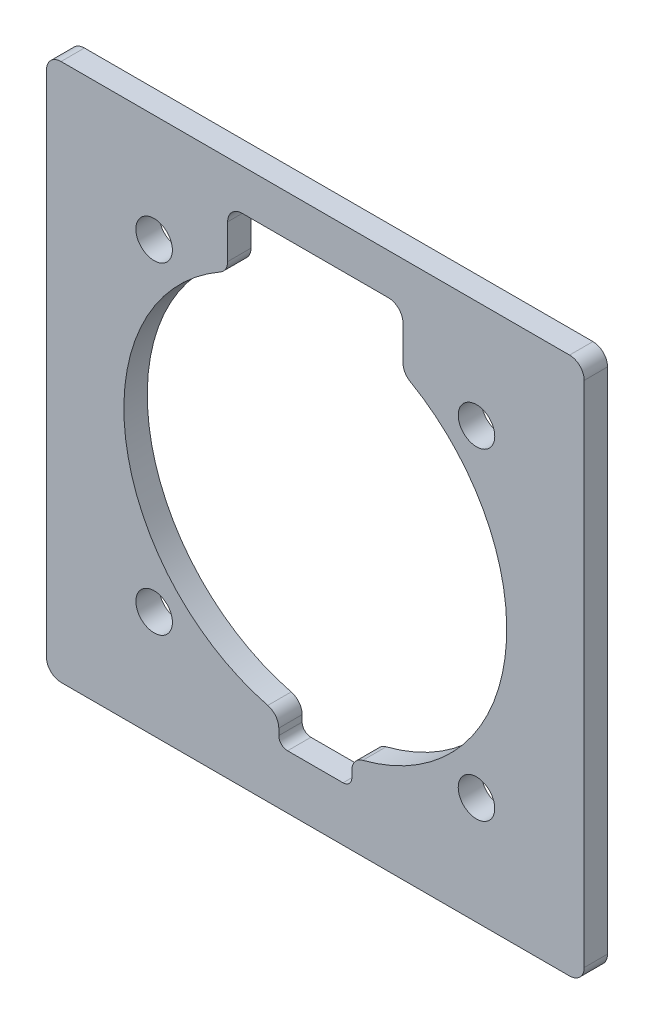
ISO-10303-21;
HEADER;
FILE_DESCRIPTION(('STEP AP214'),'2;1');
FILE_NAME('part.step','',(''),(''),'','','');
FILE_SCHEMA(('AUTOMOTIVE_DESIGN { 1 0 10303 214 1 1 1 1 }'));
ENDSEC;
DATA;
#1=APPLICATION_CONTEXT('core data for automotive mechanical design processes');
#2=APPLICATION_PROTOCOL_DEFINITION('international standard','automotive_design',2000,#1);
#3=PRODUCT_CONTEXT('',#1,'mechanical');
#4=PRODUCT('Part','Part','',(#3));
#5=PRODUCT_RELATED_PRODUCT_CATEGORY('part','',(#4));
#6=PRODUCT_DEFINITION_FORMATION('','',#4);
#7=PRODUCT_DEFINITION_CONTEXT('part definition',#1,'design');
#8=PRODUCT_DEFINITION('design','',#6,#7);
#9=PRODUCT_DEFINITION_SHAPE('','',#8);
#10=(LENGTH_UNIT() NAMED_UNIT(*) SI_UNIT(.MILLI.,.METRE.));
#11=(NAMED_UNIT(*) PLANE_ANGLE_UNIT() SI_UNIT($,.RADIAN.));
#12=(NAMED_UNIT(*) SI_UNIT($,.STERADIAN.) SOLID_ANGLE_UNIT());
#13=UNCERTAINTY_MEASURE_WITH_UNIT(LENGTH_MEASURE(1.E-05),#10,'distance_accuracy_value','');
#14=(GEOMETRIC_REPRESENTATION_CONTEXT(3) GLOBAL_UNCERTAINTY_ASSIGNED_CONTEXT((#13)) GLOBAL_UNIT_ASSIGNED_CONTEXT((#10,
#11,#12)) REPRESENTATION_CONTEXT('',''));
#15=CARTESIAN_POINT('',(0.,0.,0.));
#16=DIRECTION('',(0.,0.,1.));
#17=DIRECTION('',(1.,0.,0.));
#18=AXIS2_PLACEMENT_3D('',#15,#16,#17);
#19=CARTESIAN_POINT('',(-87.,-87.,8.));
#20=DIRECTION('',(0.,0.,1.));
#21=DIRECTION('',(1.,0.,0.));
#22=AXIS2_PLACEMENT_3D('',#19,#20,#21);
#23=PLANE('',#22);
#24=CARTESIAN_POINT('',(55.15,-55.15,8.));
#25=DIRECTION('',(0.,0.,1.));
#26=DIRECTION('',(-1.,0.,0.));
#27=AXIS2_PLACEMENT_3D('',#24,#25,#26);
#28=CIRCLE('',#27,6.25);
#29=CARTESIAN_POINT('',(48.9,-55.15,8.));
#30=VERTEX_POINT('',#29);
#31=EDGE_CURVE('E530',#30,#30,#28,.T.);
#32=ORIENTED_EDGE('',*,*,#31,.F.);
#33=EDGE_LOOP('',(#32));
#34=FACE_BOUND('',#33,.T.);
#35=DIRECTION('',(0.,-1.,0.));
#36=VECTOR('',#35,1.);
#37=CARTESIAN_POINT('',(-30.,73.,8.));
#38=LINE('',#37,#36);
#39=CARTESIAN_POINT('',(-30.,73.,8.));
#40=VERTEX_POINT('',#39);
#41=CARTESIAN_POINT('',(-30.,61.1984476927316,8.));
#42=VERTEX_POINT('',#41);
#43=EDGE_CURVE('E259',#40,#42,#38,.T.);
#44=ORIENTED_EDGE('',*,*,#43,.F.);
#45=CARTESIAN_POINT('',(-25.,73.,8.));
#46=DIRECTION('',(0.,0.,1.));
#47=DIRECTION('',(-1.,0.,0.));
#48=AXIS2_PLACEMENT_3D('',#45,#46,#47);
#49=CIRCLE('',#48,5.);
#50=CARTESIAN_POINT('',(-25.,78.,8.));
#51=VERTEX_POINT('',#50);
#52=EDGE_CURVE('E206',#51,#40,#49,.T.);
#53=ORIENTED_EDGE('',*,*,#52,.F.);
#54=DIRECTION('',(-1.,0.,0.));
#55=VECTOR('',#54,1.);
#56=CARTESIAN_POINT('',(25.,78.,8.));
#57=LINE('',#56,#55);
#58=CARTESIAN_POINT('',(25.,78.,8.));
#59=VERTEX_POINT('',#58);
#60=EDGE_CURVE('E287',#59,#51,#57,.T.);
#61=ORIENTED_EDGE('',*,*,#60,.F.);
#62=CARTESIAN_POINT('',(25.,73.,8.));
#63=DIRECTION('',(0.,0.,1.));
#64=DIRECTION('',(1.,0.,0.));
#65=AXIS2_PLACEMENT_3D('',#62,#63,#64);
#66=CIRCLE('',#65,5.);
#67=CARTESIAN_POINT('',(30.,73.,8.));
#68=VERTEX_POINT('',#67);
#69=EDGE_CURVE('E285',#68,#59,#66,.T.);
#70=ORIENTED_EDGE('',*,*,#69,.F.);
#71=DIRECTION('',(0.,1.,0.));
#72=VECTOR('',#71,1.);
#73=CARTESIAN_POINT('',(30.,73.,8.));
#74=LINE('',#73,#72);
#75=CARTESIAN_POINT('',(30.,61.1984476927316,8.));
#76=VERTEX_POINT('',#75);
#77=EDGE_CURVE('E283',#76,#68,#74,.T.);
#78=ORIENTED_EDGE('',*,*,#77,.F.);
#79=CARTESIAN_POINT('',(35.,61.1984476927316,8.));
#80=DIRECTION('',(0.,0.,-1.));
#81=DIRECTION('',(-1.,0.,0.));
#82=AXIS2_PLACEMENT_3D('',#79,#80,#81);
#83=CIRCLE('',#82,5.);
#84=CARTESIAN_POINT('',(32.5177304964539,56.8581322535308,8.));
#85=VERTEX_POINT('',#84);
#86=EDGE_CURVE('E281',#85,#76,#83,.T.);
#87=ORIENTED_EDGE('',*,*,#86,.F.);
#88=CARTESIAN_POINT('',(0.,0.,8.));
#89=DIRECTION('',(0.,0.,1.));
#90=DIRECTION('',(-1.,0.,0.));
#91=AXIS2_PLACEMENT_3D('',#88,#89,#90);
#92=CIRCLE('',#91,65.5);
#93=CARTESIAN_POINT('',(16.258865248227,-63.4499747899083,8.));
#94=VERTEX_POINT('',#93);
#95=EDGE_CURVE('E279',#94,#85,#92,.T.);
#96=ORIENTED_EDGE('',*,*,#95,.F.);
#97=CARTESIAN_POINT('',(17.5,-68.2934843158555,8.));
#98=DIRECTION('',(0.,0.,-1.));
#99=DIRECTION('',(-1.,0.,0.));
#100=AXIS2_PLACEMENT_3D('',#97,#98,#99);
#101=CIRCLE('',#100,5.);
#102=CARTESIAN_POINT('',(12.5,-68.2934843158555,8.));
#103=VERTEX_POINT('',#102);
#104=EDGE_CURVE('E277',#103,#94,#101,.T.);
#105=ORIENTED_EDGE('',*,*,#104,.F.);
#106=DIRECTION('',(0.,1.,0.));
#107=VECTOR('',#106,1.);
#108=CARTESIAN_POINT('',(12.5,-68.2934843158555,8.));
#109=LINE('',#108,#107);
#110=CARTESIAN_POINT('',(12.5,-70.5,8.));
#111=VERTEX_POINT('',#110);
#112=EDGE_CURVE('E275',#111,#103,#109,.T.);
#113=ORIENTED_EDGE('',*,*,#112,.F.);
#114=CARTESIAN_POINT('',(9.5,-70.5,8.));
#115=DIRECTION('',(0.,0.,1.));
#116=DIRECTION('',(1.,0.,0.));
#117=AXIS2_PLACEMENT_3D('',#114,#115,#116);
#118=CIRCLE('',#117,3.);
#119=CARTESIAN_POINT('',(9.5,-73.5,8.));
#120=VERTEX_POINT('',#119);
#121=EDGE_CURVE('E273',#120,#111,#118,.T.);
#122=ORIENTED_EDGE('',*,*,#121,.F.);
#123=DIRECTION('',(1.,0.,0.));
#124=VECTOR('',#123,1.);
#125=CARTESIAN_POINT('',(-9.49999999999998,-73.5,8.));
#126=LINE('',#125,#124);
#127=CARTESIAN_POINT('',(-9.49999999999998,-73.5,8.));
#128=VERTEX_POINT('',#127);
#129=EDGE_CURVE('E271',#128,#120,#126,.T.);
#130=ORIENTED_EDGE('',*,*,#129,.F.);
#131=CARTESIAN_POINT('',(-9.49999999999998,-70.5,8.));
#132=DIRECTION('',(0.,0.,1.));
#133=DIRECTION('',(-1.,0.,0.));
#134=AXIS2_PLACEMENT_3D('',#131,#132,#133);
#135=CIRCLE('',#134,3.);
#136=CARTESIAN_POINT('',(-12.5,-70.5,8.));
#137=VERTEX_POINT('',#136);
#138=EDGE_CURVE('E269',#137,#128,#135,.T.);
#139=ORIENTED_EDGE('',*,*,#138,.F.);
#140=DIRECTION('',(0.,-1.,0.));
#141=VECTOR('',#140,1.);
#142=CARTESIAN_POINT('',(-12.5,-68.2934843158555,8.));
#143=LINE('',#142,#141);
#144=CARTESIAN_POINT('',(-12.5,-68.2934843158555,8.));
#145=VERTEX_POINT('',#144);
#146=EDGE_CURVE('E267',#145,#137,#143,.T.);
#147=ORIENTED_EDGE('',*,*,#146,.F.);
#148=CARTESIAN_POINT('',(-17.5,-68.2934843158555,8.));
#149=DIRECTION('',(0.,0.,-1.));
#150=DIRECTION('',(1.,0.,0.));
#151=AXIS2_PLACEMENT_3D('',#148,#149,#150);
#152=CIRCLE('',#151,5.);
#153=CARTESIAN_POINT('',(-16.2588652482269,-63.4499747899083,8.));
#154=VERTEX_POINT('',#153);
#155=EDGE_CURVE('E265',#154,#145,#152,.T.);
#156=ORIENTED_EDGE('',*,*,#155,.F.);
#157=CARTESIAN_POINT('',(0.,0.,8.));
#158=DIRECTION('',(0.,0.,1.));
#159=DIRECTION('',(1.,0.,0.));
#160=AXIS2_PLACEMENT_3D('',#157,#158,#159);
#161=CIRCLE('',#160,65.5);
#162=CARTESIAN_POINT('',(-32.5177304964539,56.8581322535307,8.));
#163=VERTEX_POINT('',#162);
#164=EDGE_CURVE('E263',#163,#154,#161,.T.);
#165=ORIENTED_EDGE('',*,*,#164,.F.);
#166=CARTESIAN_POINT('',(-35.,61.1984476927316,8.));
#167=DIRECTION('',(0.,0.,-1.));
#168=DIRECTION('',(1.,0.,0.));
#169=AXIS2_PLACEMENT_3D('',#166,#167,#168);
#170=CIRCLE('',#169,5.);
#171=EDGE_CURVE('E261',#42,#163,#170,.T.);
#172=ORIENTED_EDGE('',*,*,#171,.F.);
#173=EDGE_LOOP('',(#44,#53,#61,#70,#78,#87,#96,#105,#113,#122,#130,#139,#147,#156,#165,#172));
#174=FACE_BOUND('',#173,.T.);
#175=CARTESIAN_POINT('',(-87.,-87.,8.));
#176=DIRECTION('',(0.,0.,1.));
#177=DIRECTION('',(1.,0.,0.));
#178=AXIS2_PLACEMENT_3D('',#175,#176,#177);
#179=CIRCLE('',#178,5.);
#180=CARTESIAN_POINT('',(-92.,-87.,8.));
#181=VERTEX_POINT('',#180);
#182=CARTESIAN_POINT('',(-87.,-92.,8.));
#183=VERTEX_POINT('',#182);
#184=EDGE_CURVE('E339',#181,#183,#179,.T.);
#185=ORIENTED_EDGE('',*,*,#184,.T.);
#186=DIRECTION('',(1.,0.,0.));
#187=VECTOR('',#186,1.);
#188=CARTESIAN_POINT('',(-87.,-92.,8.));
#189=LINE('',#188,#187);
#190=CARTESIAN_POINT('',(87.,-92.,8.));
#191=VERTEX_POINT('',#190);
#192=EDGE_CURVE('E342',#183,#191,#189,.T.);
#193=ORIENTED_EDGE('',*,*,#192,.T.);
#194=CARTESIAN_POINT('',(87.,-87.,8.));
#195=DIRECTION('',(0.,0.,1.));
#196=DIRECTION('',(-1.,0.,0.));
#197=AXIS2_PLACEMENT_3D('',#194,#195,#196);
#198=CIRCLE('',#197,5.);
#199=CARTESIAN_POINT('',(92.,-87.,8.));
#200=VERTEX_POINT('',#199);
#201=EDGE_CURVE('E344',#191,#200,#198,.T.);
#202=ORIENTED_EDGE('',*,*,#201,.T.);
#203=DIRECTION('',(0.,1.,0.));
#204=VECTOR('',#203,1.);
#205=CARTESIAN_POINT('',(92.,87.,8.));
#206=LINE('',#205,#204);
#207=CARTESIAN_POINT('',(92.,87.,8.));
#208=VERTEX_POINT('',#207);
#209=EDGE_CURVE('E346',#200,#208,#206,.T.);
#210=ORIENTED_EDGE('',*,*,#209,.T.);
#211=CARTESIAN_POINT('',(87.,87.,8.));
#212=DIRECTION('',(0.,0.,1.));
#213=DIRECTION('',(1.,0.,0.));
#214=AXIS2_PLACEMENT_3D('',#211,#212,#213);
#215=CIRCLE('',#214,5.);
#216=CARTESIAN_POINT('',(87.,92.,8.));
#217=VERTEX_POINT('',#216);
#218=EDGE_CURVE('E348',#208,#217,#215,.T.);
#219=ORIENTED_EDGE('',*,*,#218,.T.);
#220=DIRECTION('',(-1.,0.,0.));
#221=VECTOR('',#220,1.);
#222=CARTESIAN_POINT('',(-87.,92.,8.));
#223=LINE('',#222,#221);
#224=CARTESIAN_POINT('',(-87.,92.,8.));
#225=VERTEX_POINT('',#224);
#226=EDGE_CURVE('E350',#217,#225,#223,.T.);
#227=ORIENTED_EDGE('',*,*,#226,.T.);
#228=CARTESIAN_POINT('',(-87.,87.,8.));
#229=DIRECTION('',(0.,0.,1.));
#230=DIRECTION('',(-1.,0.,0.));
#231=AXIS2_PLACEMENT_3D('',#228,#229,#230);
#232=CIRCLE('',#231,5.);
#233=CARTESIAN_POINT('',(-92.,87.,8.));
#234=VERTEX_POINT('',#233);
#235=EDGE_CURVE('E352',#225,#234,#232,.T.);
#236=ORIENTED_EDGE('',*,*,#235,.T.);
#237=DIRECTION('',(0.,-1.,0.));
#238=VECTOR('',#237,1.);
#239=CARTESIAN_POINT('',(-92.,87.,8.));
#240=LINE('',#239,#238);
#241=EDGE_CURVE('E354',#234,#181,#240,.T.);
#242=ORIENTED_EDGE('',*,*,#241,.T.);
#243=EDGE_LOOP('',(#185,#193,#202,#210,#219,#227,#236,#242));
#244=FACE_BOUND('',#243,.T.);
#245=CARTESIAN_POINT('',(-55.15,55.15,8.));
#246=DIRECTION('',(0.,0.,1.));
#247=DIRECTION('',(-1.,0.,0.));
#248=AXIS2_PLACEMENT_3D('',#245,#246,#247);
#249=CIRCLE('',#248,6.25);
#250=CARTESIAN_POINT('',(-61.4,55.15,8.));
#251=VERTEX_POINT('',#250);
#252=EDGE_CURVE('E319',#251,#251,#249,.T.);
#253=ORIENTED_EDGE('',*,*,#252,.F.);
#254=EDGE_LOOP('',(#253));
#255=FACE_BOUND('',#254,.T.);
#256=CARTESIAN_POINT('',(-55.15,-55.15,8.));
#257=DIRECTION('',(0.,0.,1.));
#258=DIRECTION('',(1.,0.,0.));
#259=AXIS2_PLACEMENT_3D('',#256,#257,#258);
#260=CIRCLE('',#259,6.25);
#261=CARTESIAN_POINT('',(-48.9,-55.15,8.));
#262=VERTEX_POINT('',#261);
#263=EDGE_CURVE('E214',#262,#262,#260,.T.);
#264=ORIENTED_EDGE('',*,*,#263,.F.);
#265=EDGE_LOOP('',(#264));
#266=FACE_BOUND('',#265,.T.);
#267=CARTESIAN_POINT('',(55.15,55.15,8.));
#268=DIRECTION('',(0.,0.,1.));
#269=DIRECTION('',(1.,0.,0.));
#270=AXIS2_PLACEMENT_3D('',#267,#268,#269);
#271=CIRCLE('',#270,6.25);
#272=CARTESIAN_POINT('',(61.4,55.15,8.));
#273=VERTEX_POINT('',#272);
#274=EDGE_CURVE('E519',#273,#273,#271,.T.);
#275=ORIENTED_EDGE('',*,*,#274,.F.);
#276=EDGE_LOOP('',(#275));
#277=FACE_BOUND('',#276,.T.);
#278=ADVANCED_FACE('F30',(#34,#174,#244,#255,#266,#277),#23,.T.);
#279=CARTESIAN_POINT('',(-87.,-87.,0.));
#280=DIRECTION('',(0.,0.,1.));
#281=DIRECTION('',(1.,0.,0.));
#282=AXIS2_PLACEMENT_3D('',#279,#280,#281);
#283=PLANE('',#282);
#284=CARTESIAN_POINT('',(55.15,-55.15,0.));
#285=DIRECTION('',(0.,0.,1.));
#286=DIRECTION('',(-1.,0.,0.));
#287=AXIS2_PLACEMENT_3D('',#284,#285,#286);
#288=CIRCLE('',#287,6.25);
#289=CARTESIAN_POINT('',(48.9,-55.15,0.));
#290=VERTEX_POINT('',#289);
#291=EDGE_CURVE('E525',#290,#290,#288,.T.);
#292=ORIENTED_EDGE('',*,*,#291,.T.);
#293=EDGE_LOOP('',(#292));
#294=FACE_BOUND('',#293,.T.);
#295=CARTESIAN_POINT('',(-25.,73.,0.));
#296=DIRECTION('',(0.,0.,1.));
#297=DIRECTION('',(-1.,0.,0.));
#298=AXIS2_PLACEMENT_3D('',#295,#296,#297);
#299=CIRCLE('',#298,5.);
#300=CARTESIAN_POINT('',(-25.,78.,0.));
#301=VERTEX_POINT('',#300);
#302=CARTESIAN_POINT('',(-30.,73.,0.));
#303=VERTEX_POINT('',#302);
#304=EDGE_CURVE('E53',#301,#303,#299,.T.);
#305=ORIENTED_EDGE('',*,*,#304,.T.);
#306=DIRECTION('',(0.,-1.,0.));
#307=VECTOR('',#306,1.);
#308=CARTESIAN_POINT('',(-30.,73.,0.));
#309=LINE('',#308,#307);
#310=CARTESIAN_POINT('',(-30.,61.1984476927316,0.));
#311=VERTEX_POINT('',#310);
#312=EDGE_CURVE('E193',#303,#311,#309,.T.);
#313=ORIENTED_EDGE('',*,*,#312,.T.);
#314=CARTESIAN_POINT('',(-35.,61.1984476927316,0.));
#315=DIRECTION('',(0.,0.,-1.));
#316=DIRECTION('',(1.,0.,0.));
#317=AXIS2_PLACEMENT_3D('',#314,#315,#316);
#318=CIRCLE('',#317,5.);
#319=CARTESIAN_POINT('',(-32.5177304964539,56.8581322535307,0.));
#320=VERTEX_POINT('',#319);
#321=EDGE_CURVE('E202',#311,#320,#318,.T.);
#322=ORIENTED_EDGE('',*,*,#321,.T.);
#323=CARTESIAN_POINT('',(0.,0.,0.));
#324=DIRECTION('',(0.,0.,1.));
#325=DIRECTION('',(1.,0.,0.));
#326=AXIS2_PLACEMENT_3D('',#323,#324,#325);
#327=CIRCLE('',#326,65.5);
#328=CARTESIAN_POINT('',(-16.2588652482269,-63.4499747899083,0.));
#329=VERTEX_POINT('',#328);
#330=EDGE_CURVE('E222',#320,#329,#327,.T.);
#331=ORIENTED_EDGE('',*,*,#330,.T.);
#332=CARTESIAN_POINT('',(-17.5,-68.2934843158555,0.));
#333=DIRECTION('',(0.,0.,-1.));
#334=DIRECTION('',(1.,0.,0.));
#335=AXIS2_PLACEMENT_3D('',#332,#333,#334);
#336=CIRCLE('',#335,5.);
#337=CARTESIAN_POINT('',(-12.5,-68.2934843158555,0.));
#338=VERTEX_POINT('',#337);
#339=EDGE_CURVE('E225',#329,#338,#336,.T.);
#340=ORIENTED_EDGE('',*,*,#339,.T.);
#341=DIRECTION('',(0.,-1.,0.));
#342=VECTOR('',#341,1.);
#343=CARTESIAN_POINT('',(-12.5,-68.2934843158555,0.));
#344=LINE('',#343,#342);
#345=CARTESIAN_POINT('',(-12.5,-70.5,0.));
#346=VERTEX_POINT('',#345);
#347=EDGE_CURVE('E228',#338,#346,#344,.T.);
#348=ORIENTED_EDGE('',*,*,#347,.T.);
#349=CARTESIAN_POINT('',(-9.49999999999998,-70.5,0.));
#350=DIRECTION('',(0.,0.,1.));
#351=DIRECTION('',(-1.,0.,0.));
#352=AXIS2_PLACEMENT_3D('',#349,#350,#351);
#353=CIRCLE('',#352,3.);
#354=CARTESIAN_POINT('',(-9.49999999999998,-73.5,0.));
#355=VERTEX_POINT('',#354);
#356=EDGE_CURVE('E231',#346,#355,#353,.T.);
#357=ORIENTED_EDGE('',*,*,#356,.T.);
#358=DIRECTION('',(1.,0.,0.));
#359=VECTOR('',#358,1.);
#360=CARTESIAN_POINT('',(-9.49999999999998,-73.5,0.));
#361=LINE('',#360,#359);
#362=CARTESIAN_POINT('',(9.5,-73.5,0.));
#363=VERTEX_POINT('',#362);
#364=EDGE_CURVE('E234',#355,#363,#361,.T.);
#365=ORIENTED_EDGE('',*,*,#364,.T.);
#366=CARTESIAN_POINT('',(9.5,-70.5,0.));
#367=DIRECTION('',(0.,0.,1.));
#368=DIRECTION('',(1.,0.,0.));
#369=AXIS2_PLACEMENT_3D('',#366,#367,#368);
#370=CIRCLE('',#369,3.);
#371=CARTESIAN_POINT('',(12.5,-70.5,0.));
#372=VERTEX_POINT('',#371);
#373=EDGE_CURVE('E237',#363,#372,#370,.T.);
#374=ORIENTED_EDGE('',*,*,#373,.T.);
#375=DIRECTION('',(0.,1.,0.));
#376=VECTOR('',#375,1.);
#377=CARTESIAN_POINT('',(12.5,-68.2934843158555,0.));
#378=LINE('',#377,#376);
#379=CARTESIAN_POINT('',(12.5,-68.2934843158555,0.));
#380=VERTEX_POINT('',#379);
#381=EDGE_CURVE('E240',#372,#380,#378,.T.);
#382=ORIENTED_EDGE('',*,*,#381,.T.);
#383=CARTESIAN_POINT('',(17.5,-68.2934843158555,0.));
#384=DIRECTION('',(0.,0.,-1.));
#385=DIRECTION('',(-1.,0.,0.));
#386=AXIS2_PLACEMENT_3D('',#383,#384,#385);
#387=CIRCLE('',#386,5.);
#388=CARTESIAN_POINT('',(16.258865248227,-63.4499747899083,0.));
#389=VERTEX_POINT('',#388);
#390=EDGE_CURVE('E243',#380,#389,#387,.T.);
#391=ORIENTED_EDGE('',*,*,#390,.T.);
#392=CARTESIAN_POINT('',(0.,0.,0.));
#393=DIRECTION('',(0.,0.,1.));
#394=DIRECTION('',(-1.,0.,0.));
#395=AXIS2_PLACEMENT_3D('',#392,#393,#394);
#396=CIRCLE('',#395,65.5);
#397=CARTESIAN_POINT('',(32.5177304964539,56.8581322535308,0.));
#398=VERTEX_POINT('',#397);
#399=EDGE_CURVE('E246',#389,#398,#396,.T.);
#400=ORIENTED_EDGE('',*,*,#399,.T.);
#401=CARTESIAN_POINT('',(35.,61.1984476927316,0.));
#402=DIRECTION('',(0.,0.,-1.));
#403=DIRECTION('',(-1.,0.,0.));
#404=AXIS2_PLACEMENT_3D('',#401,#402,#403);
#405=CIRCLE('',#404,5.);
#406=CARTESIAN_POINT('',(30.,61.1984476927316,0.));
#407=VERTEX_POINT('',#406);
#408=EDGE_CURVE('E249',#398,#407,#405,.T.);
#409=ORIENTED_EDGE('',*,*,#408,.T.);
#410=DIRECTION('',(0.,1.,0.));
#411=VECTOR('',#410,1.);
#412=CARTESIAN_POINT('',(30.,73.,0.));
#413=LINE('',#412,#411);
#414=CARTESIAN_POINT('',(30.,73.,0.));
#415=VERTEX_POINT('',#414);
#416=EDGE_CURVE('E252',#407,#415,#413,.T.);
#417=ORIENTED_EDGE('',*,*,#416,.T.);
#418=CARTESIAN_POINT('',(25.,73.,0.));
#419=DIRECTION('',(0.,0.,1.));
#420=DIRECTION('',(1.,0.,0.));
#421=AXIS2_PLACEMENT_3D('',#418,#419,#420);
#422=CIRCLE('',#421,5.);
#423=CARTESIAN_POINT('',(25.,78.,0.));
#424=VERTEX_POINT('',#423);
#425=EDGE_CURVE('E255',#415,#424,#422,.T.);
#426=ORIENTED_EDGE('',*,*,#425,.T.);
#427=DIRECTION('',(-1.,0.,0.));
#428=VECTOR('',#427,1.);
#429=CARTESIAN_POINT('',(25.,78.,0.));
#430=LINE('',#429,#428);
#431=EDGE_CURVE('E213',#424,#301,#430,.T.);
#432=ORIENTED_EDGE('',*,*,#431,.T.);
#433=EDGE_LOOP('',(#305,#313,#322,#331,#340,#348,#357,#365,#374,#382,#391,#400,#409,#417,#426,#432));
#434=FACE_BOUND('',#433,.T.);
#435=CARTESIAN_POINT('',(-87.,-87.,0.));
#436=DIRECTION('',(0.,0.,1.));
#437=DIRECTION('',(1.,0.,0.));
#438=AXIS2_PLACEMENT_3D('',#435,#436,#437);
#439=CIRCLE('',#438,5.);
#440=CARTESIAN_POINT('',(-92.,-87.,0.));
#441=VERTEX_POINT('',#440);
#442=CARTESIAN_POINT('',(-87.,-92.,0.));
#443=VERTEX_POINT('',#442);
#444=EDGE_CURVE('E322',#441,#443,#439,.T.);
#445=ORIENTED_EDGE('',*,*,#444,.F.);
#446=DIRECTION('',(0.,-1.,0.));
#447=VECTOR('',#446,1.);
#448=CARTESIAN_POINT('',(-92.,87.,0.));
#449=LINE('',#448,#447);
#450=CARTESIAN_POINT('',(-92.,87.,0.));
#451=VERTEX_POINT('',#450);
#452=EDGE_CURVE('E337',#451,#441,#449,.T.);
#453=ORIENTED_EDGE('',*,*,#452,.F.);
#454=CARTESIAN_POINT('',(-87.,87.,0.));
#455=DIRECTION('',(0.,0.,1.));
#456=DIRECTION('',(-1.,0.,0.));
#457=AXIS2_PLACEMENT_3D('',#454,#455,#456);
#458=CIRCLE('',#457,5.);
#459=CARTESIAN_POINT('',(-87.,92.,0.));
#460=VERTEX_POINT('',#459);
#461=EDGE_CURVE('E335',#460,#451,#458,.T.);
#462=ORIENTED_EDGE('',*,*,#461,.F.);
#463=DIRECTION('',(-1.,0.,0.));
#464=VECTOR('',#463,1.);
#465=CARTESIAN_POINT('',(-87.,92.,0.));
#466=LINE('',#465,#464);
#467=CARTESIAN_POINT('',(87.,92.,0.));
#468=VERTEX_POINT('',#467);
#469=EDGE_CURVE('E333',#468,#460,#466,.T.);
#470=ORIENTED_EDGE('',*,*,#469,.F.);
#471=CARTESIAN_POINT('',(87.,87.,0.));
#472=DIRECTION('',(0.,0.,1.));
#473=DIRECTION('',(1.,0.,0.));
#474=AXIS2_PLACEMENT_3D('',#471,#472,#473);
#475=CIRCLE('',#474,5.);
#476=CARTESIAN_POINT('',(92.,87.,0.));
#477=VERTEX_POINT('',#476);
#478=EDGE_CURVE('E331',#477,#468,#475,.T.);
#479=ORIENTED_EDGE('',*,*,#478,.F.);
#480=DIRECTION('',(0.,1.,0.));
#481=VECTOR('',#480,1.);
#482=CARTESIAN_POINT('',(92.,87.,0.));
#483=LINE('',#482,#481);
#484=CARTESIAN_POINT('',(92.,-87.,0.));
#485=VERTEX_POINT('',#484);
#486=EDGE_CURVE('E329',#485,#477,#483,.T.);
#487=ORIENTED_EDGE('',*,*,#486,.F.);
#488=CARTESIAN_POINT('',(87.,-87.,0.));
#489=DIRECTION('',(0.,0.,1.));
#490=DIRECTION('',(-1.,0.,0.));
#491=AXIS2_PLACEMENT_3D('',#488,#489,#490);
#492=CIRCLE('',#491,5.);
#493=CARTESIAN_POINT('',(87.,-92.,0.));
#494=VERTEX_POINT('',#493);
#495=EDGE_CURVE('E327',#494,#485,#492,.T.);
#496=ORIENTED_EDGE('',*,*,#495,.F.);
#497=DIRECTION('',(1.,0.,0.));
#498=VECTOR('',#497,1.);
#499=CARTESIAN_POINT('',(-87.,-92.,0.));
#500=LINE('',#499,#498);
#501=EDGE_CURVE('E325',#443,#494,#500,.T.);
#502=ORIENTED_EDGE('',*,*,#501,.F.);
#503=EDGE_LOOP('',(#445,#453,#462,#470,#479,#487,#496,#502));
#504=FACE_BOUND('',#503,.T.);
#505=CARTESIAN_POINT('',(-55.15,55.15,0.));
#506=DIRECTION('',(0.,0.,1.));
#507=DIRECTION('',(-1.,0.,0.));
#508=AXIS2_PLACEMENT_3D('',#505,#506,#507);
#509=CIRCLE('',#508,6.25);
#510=CARTESIAN_POINT('',(-61.4,55.15,0.));
#511=VERTEX_POINT('',#510);
#512=EDGE_CURVE('E207',#511,#511,#509,.T.);
#513=ORIENTED_EDGE('',*,*,#512,.T.);
#514=EDGE_LOOP('',(#513));
#515=FACE_BOUND('',#514,.T.);
#516=CARTESIAN_POINT('',(-55.15,-55.15,0.));
#517=DIRECTION('',(0.,0.,1.));
#518=DIRECTION('',(1.,0.,0.));
#519=AXIS2_PLACEMENT_3D('',#516,#517,#518);
#520=CIRCLE('',#519,6.25);
#521=CARTESIAN_POINT('',(-48.9,-55.15,0.));
#522=VERTEX_POINT('',#521);
#523=EDGE_CURVE('E217',#522,#522,#520,.T.);
#524=ORIENTED_EDGE('',*,*,#523,.T.);
#525=EDGE_LOOP('',(#524));
#526=FACE_BOUND('',#525,.T.);
#527=CARTESIAN_POINT('',(55.15,55.15,0.));
#528=DIRECTION('',(0.,0.,1.));
#529=DIRECTION('',(1.,0.,0.));
#530=AXIS2_PLACEMENT_3D('',#527,#528,#529);
#531=CIRCLE('',#530,6.25);
#532=CARTESIAN_POINT('',(61.4,55.15,0.));
#533=VERTEX_POINT('',#532);
#534=EDGE_CURVE('E522',#533,#533,#531,.T.);
#535=ORIENTED_EDGE('',*,*,#534,.T.);
#536=EDGE_LOOP('',(#535));
#537=FACE_BOUND('',#536,.T.);
#538=ADVANCED_FACE('F210',(#294,#434,#504,#515,#526,#537),#283,.F.);
#539=CARTESIAN_POINT('',(-87.,-87.,8.));
#540=DIRECTION('',(0.,0.,-1.));
#541=DIRECTION('',(-1.,0.,0.));
#542=AXIS2_PLACEMENT_3D('',#539,#540,#541);
#543=CYLINDRICAL_SURFACE('',#542,5.);
#544=ORIENTED_EDGE('',*,*,#444,.T.);
#545=DIRECTION('',(0.,0.,-1.));
#546=VECTOR('',#545,1.);
#547=CARTESIAN_POINT('',(-87.,-92.,8.));
#548=LINE('',#547,#546);
#549=EDGE_CURVE('E11',#183,#443,#548,.T.);
#550=ORIENTED_EDGE('',*,*,#549,.F.);
#551=ORIENTED_EDGE('',*,*,#184,.F.);
#552=DIRECTION('',(0.,0.,-1.));
#553=VECTOR('',#552,1.);
#554=CARTESIAN_POINT('',(-92.,-87.,8.));
#555=LINE('',#554,#553);
#556=EDGE_CURVE('E356',#181,#441,#555,.T.);
#557=ORIENTED_EDGE('',*,*,#556,.T.);
#558=EDGE_LOOP('',(#544,#550,#551,#557));
#559=FACE_BOUND('',#558,.T.);
#560=ADVANCED_FACE('F32',(#559),#543,.T.);
#561=CARTESIAN_POINT('',(-87.,-92.,8.));
#562=DIRECTION('',(0.,1.,0.));
#563=DIRECTION('',(0.,0.,1.));
#564=AXIS2_PLACEMENT_3D('',#561,#562,#563);
#565=PLANE('',#564);
#566=ORIENTED_EDGE('',*,*,#501,.T.);
#567=DIRECTION('',(0.,0.,-1.));
#568=VECTOR('',#567,1.);
#569=CARTESIAN_POINT('',(87.,-92.,8.));
#570=LINE('',#569,#568);
#571=EDGE_CURVE('E38',#191,#494,#570,.T.);
#572=ORIENTED_EDGE('',*,*,#571,.F.);
#573=ORIENTED_EDGE('',*,*,#192,.F.);
#574=ORIENTED_EDGE('',*,*,#549,.T.);
#575=EDGE_LOOP('',(#566,#572,#573,#574));
#576=FACE_BOUND('',#575,.T.);
#577=ADVANCED_FACE('F400',(#576),#565,.F.);
#578=CARTESIAN_POINT('',(87.,-87.,8.));
#579=DIRECTION('',(0.,0.,-1.));
#580=DIRECTION('',(-1.,0.,0.));
#581=AXIS2_PLACEMENT_3D('',#578,#579,#580);
#582=CYLINDRICAL_SURFACE('',#581,5.);
#583=ORIENTED_EDGE('',*,*,#495,.T.);
#584=DIRECTION('',(0.,0.,-1.));
#585=VECTOR('',#584,1.);
#586=CARTESIAN_POINT('',(92.,-87.,8.));
#587=LINE('',#586,#585);
#588=EDGE_CURVE('E371',#200,#485,#587,.T.);
#589=ORIENTED_EDGE('',*,*,#588,.F.);
#590=ORIENTED_EDGE('',*,*,#201,.F.);
#591=ORIENTED_EDGE('',*,*,#571,.T.);
#592=EDGE_LOOP('',(#583,#589,#590,#591));
#593=FACE_BOUND('',#592,.T.);
#594=ADVANCED_FACE('F378',(#593),#582,.T.);
#595=CARTESIAN_POINT('',(92.,87.,8.));
#596=DIRECTION('',(-1.,0.,0.));
#597=DIRECTION('',(0.,-1.,0.));
#598=AXIS2_PLACEMENT_3D('',#595,#596,#597);
#599=PLANE('',#598);
#600=ORIENTED_EDGE('',*,*,#486,.T.);
#601=DIRECTION('',(0.,0.,-1.));
#602=VECTOR('',#601,1.);
#603=CARTESIAN_POINT('',(92.,87.,8.));
#604=LINE('',#603,#602);
#605=EDGE_CURVE('E368',#208,#477,#604,.T.);
#606=ORIENTED_EDGE('',*,*,#605,.F.);
#607=ORIENTED_EDGE('',*,*,#209,.F.);
#608=ORIENTED_EDGE('',*,*,#588,.T.);
#609=EDGE_LOOP('',(#600,#606,#607,#608));
#610=FACE_BOUND('',#609,.T.);
#611=ADVANCED_FACE('F388',(#610),#599,.F.);
#612=CARTESIAN_POINT('',(87.,87.,8.));
#613=DIRECTION('',(0.,0.,-1.));
#614=DIRECTION('',(-1.,0.,0.));
#615=AXIS2_PLACEMENT_3D('',#612,#613,#614);
#616=CYLINDRICAL_SURFACE('',#615,5.);
#617=ORIENTED_EDGE('',*,*,#478,.T.);
#618=DIRECTION('',(0.,0.,-1.));
#619=VECTOR('',#618,1.);
#620=CARTESIAN_POINT('',(87.,92.,8.));
#621=LINE('',#620,#619);
#622=EDGE_CURVE('E365',#217,#468,#621,.T.);
#623=ORIENTED_EDGE('',*,*,#622,.F.);
#624=ORIENTED_EDGE('',*,*,#218,.F.);
#625=ORIENTED_EDGE('',*,*,#605,.T.);
#626=EDGE_LOOP('',(#617,#623,#624,#625));
#627=FACE_BOUND('',#626,.T.);
#628=ADVANCED_FACE('F392',(#627),#616,.T.);
#629=CARTESIAN_POINT('',(-87.,92.,8.));
#630=DIRECTION('',(0.,-1.,0.));
#631=DIRECTION('',(1.,0.,0.));
#632=AXIS2_PLACEMENT_3D('',#629,#630,#631);
#633=PLANE('',#632);
#634=ORIENTED_EDGE('',*,*,#469,.T.);
#635=DIRECTION('',(0.,0.,-1.));
#636=VECTOR('',#635,1.);
#637=CARTESIAN_POINT('',(-87.,92.,8.));
#638=LINE('',#637,#636);
#639=EDGE_CURVE('E362',#225,#460,#638,.T.);
#640=ORIENTED_EDGE('',*,*,#639,.F.);
#641=ORIENTED_EDGE('',*,*,#226,.F.);
#642=ORIENTED_EDGE('',*,*,#622,.T.);
#643=EDGE_LOOP('',(#634,#640,#641,#642));
#644=FACE_BOUND('',#643,.T.);
#645=ADVANCED_FACE('F413',(#644),#633,.F.);
#646=CARTESIAN_POINT('',(-87.,87.,8.));
#647=DIRECTION('',(0.,0.,-1.));
#648=DIRECTION('',(-1.,0.,0.));
#649=AXIS2_PLACEMENT_3D('',#646,#647,#648);
#650=CYLINDRICAL_SURFACE('',#649,5.);
#651=ORIENTED_EDGE('',*,*,#461,.T.);
#652=DIRECTION('',(0.,0.,-1.));
#653=VECTOR('',#652,1.);
#654=CARTESIAN_POINT('',(-92.,87.,8.));
#655=LINE('',#654,#653);
#656=EDGE_CURVE('E359',#234,#451,#655,.T.);
#657=ORIENTED_EDGE('',*,*,#656,.F.);
#658=ORIENTED_EDGE('',*,*,#235,.F.);
#659=ORIENTED_EDGE('',*,*,#639,.T.);
#660=EDGE_LOOP('',(#651,#657,#658,#659));
#661=FACE_BOUND('',#660,.T.);
#662=ADVANCED_FACE('F411',(#661),#650,.T.);
#663=CARTESIAN_POINT('',(-92.,87.,8.));
#664=DIRECTION('',(1.,0.,0.));
#665=DIRECTION('',(0.,1.,0.));
#666=AXIS2_PLACEMENT_3D('',#663,#664,#665);
#667=PLANE('',#666);
#668=ORIENTED_EDGE('',*,*,#452,.T.);
#669=ORIENTED_EDGE('',*,*,#556,.F.);
#670=ORIENTED_EDGE('',*,*,#241,.F.);
#671=ORIENTED_EDGE('',*,*,#656,.T.);
#672=EDGE_LOOP('',(#668,#669,#670,#671));
#673=FACE_BOUND('',#672,.T.);
#674=ADVANCED_FACE('F406',(#673),#667,.F.);
#675=CARTESIAN_POINT('',(-55.15,55.15,8.));
#676=DIRECTION('',(0.,0.,-1.));
#677=DIRECTION('',(-1.,0.,0.));
#678=AXIS2_PLACEMENT_3D('',#675,#676,#677);
#679=CYLINDRICAL_SURFACE('',#678,6.25);
#680=ORIENTED_EDGE('',*,*,#252,.T.);
#681=EDGE_LOOP('',(#680));
#682=FACE_BOUND('',#681,.T.);
#683=ORIENTED_EDGE('',*,*,#512,.F.);
#684=EDGE_LOOP('',(#683));
#685=FACE_BOUND('',#684,.T.);
#686=ADVANCED_FACE('F435',(#682,#685),#679,.F.);
#687=CARTESIAN_POINT('',(-25.,73.,8.));
#688=DIRECTION('',(0.,0.,-1.));
#689=DIRECTION('',(-1.,0.,0.));
#690=AXIS2_PLACEMENT_3D('',#687,#688,#689);
#691=CYLINDRICAL_SURFACE('',#690,5.);
#692=ORIENTED_EDGE('',*,*,#304,.F.);
#693=DIRECTION('',(0.,0.,-1.));
#694=VECTOR('',#693,1.);
#695=CARTESIAN_POINT('',(-25.,78.,8.));
#696=LINE('',#695,#694);
#697=EDGE_CURVE('E289',#51,#301,#696,.T.);
#698=ORIENTED_EDGE('',*,*,#697,.F.);
#699=ORIENTED_EDGE('',*,*,#52,.T.);
#700=DIRECTION('',(0.,0.,-1.));
#701=VECTOR('',#700,1.);
#702=CARTESIAN_POINT('',(-30.,73.,8.));
#703=LINE('',#702,#701);
#704=EDGE_CURVE('E195',#40,#303,#703,.T.);
#705=ORIENTED_EDGE('',*,*,#704,.T.);
#706=EDGE_LOOP('',(#692,#698,#699,#705));
#707=FACE_BOUND('',#706,.T.);
#708=ADVANCED_FACE('F204',(#707),#691,.F.);
#709=CARTESIAN_POINT('',(-30.,73.,8.));
#710=DIRECTION('',(1.,0.,0.));
#711=DIRECTION('',(0.,0.,-1.));
#712=AXIS2_PLACEMENT_3D('',#709,#710,#711);
#713=PLANE('',#712);
#714=ORIENTED_EDGE('',*,*,#312,.F.);
#715=ORIENTED_EDGE('',*,*,#704,.F.);
#716=ORIENTED_EDGE('',*,*,#43,.T.);
#717=DIRECTION('',(0.,0.,-1.));
#718=VECTOR('',#717,1.);
#719=CARTESIAN_POINT('',(-30.,61.1984476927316,8.));
#720=LINE('',#719,#718);
#721=EDGE_CURVE('E198',#42,#311,#720,.T.);
#722=ORIENTED_EDGE('',*,*,#721,.T.);
#723=EDGE_LOOP('',(#714,#715,#716,#722));
#724=FACE_BOUND('',#723,.T.);
#725=ADVANCED_FACE('F194',(#724),#713,.T.);
#726=CARTESIAN_POINT('',(-35.,61.1984476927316,8.));
#727=DIRECTION('',(0.,0.,-1.));
#728=DIRECTION('',(-1.,0.,0.));
#729=AXIS2_PLACEMENT_3D('',#726,#727,#728);
#730=CYLINDRICAL_SURFACE('',#729,5.);
#731=ORIENTED_EDGE('',*,*,#321,.F.);
#732=ORIENTED_EDGE('',*,*,#721,.F.);
#733=ORIENTED_EDGE('',*,*,#171,.T.);
#734=DIRECTION('',(0.,0.,-1.));
#735=VECTOR('',#734,1.);
#736=CARTESIAN_POINT('',(-32.5177304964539,56.8581322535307,8.));
#737=LINE('',#736,#735);
#738=EDGE_CURVE('E314',#163,#320,#737,.T.);
#739=ORIENTED_EDGE('',*,*,#738,.T.);
#740=EDGE_LOOP('',(#731,#732,#733,#739));
#741=FACE_BOUND('',#740,.T.);
#742=ADVANCED_FACE('F448',(#741),#730,.T.);
#743=CARTESIAN_POINT('',(0.,0.,8.));
#744=DIRECTION('',(0.,0.,-1.));
#745=DIRECTION('',(-1.,0.,0.));
#746=AXIS2_PLACEMENT_3D('',#743,#744,#745);
#747=CYLINDRICAL_SURFACE('',#746,65.5);
#748=ORIENTED_EDGE('',*,*,#330,.F.);
#749=ORIENTED_EDGE('',*,*,#738,.F.);
#750=ORIENTED_EDGE('',*,*,#164,.T.);
#751=DIRECTION('',(0.,0.,-1.));
#752=VECTOR('',#751,1.);
#753=CARTESIAN_POINT('',(-16.2588652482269,-63.4499747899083,8.));
#754=LINE('',#753,#752);
#755=EDGE_CURVE('E312',#154,#329,#754,.T.);
#756=ORIENTED_EDGE('',*,*,#755,.T.);
#757=EDGE_LOOP('',(#748,#749,#750,#756));
#758=FACE_BOUND('',#757,.T.);
#759=ADVANCED_FACE('F451',(#758),#747,.F.);
#760=CARTESIAN_POINT('',(-17.5,-68.2934843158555,8.));
#761=DIRECTION('',(0.,0.,-1.));
#762=DIRECTION('',(-1.,0.,0.));
#763=AXIS2_PLACEMENT_3D('',#760,#761,#762);
#764=CYLINDRICAL_SURFACE('',#763,5.);
#765=ORIENTED_EDGE('',*,*,#339,.F.);
#766=ORIENTED_EDGE('',*,*,#755,.F.);
#767=ORIENTED_EDGE('',*,*,#155,.T.);
#768=DIRECTION('',(0.,0.,-1.));
#769=VECTOR('',#768,1.);
#770=CARTESIAN_POINT('',(-12.5,-68.2934843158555,8.));
#771=LINE('',#770,#769);
#772=EDGE_CURVE('E310',#145,#338,#771,.T.);
#773=ORIENTED_EDGE('',*,*,#772,.T.);
#774=EDGE_LOOP('',(#765,#766,#767,#773));
#775=FACE_BOUND('',#774,.T.);
#776=ADVANCED_FACE('F455',(#775),#764,.T.);
#777=CARTESIAN_POINT('',(-12.5,-68.2934843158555,8.));
#778=DIRECTION('',(1.,0.,0.));
#779=DIRECTION('',(0.,1.,0.));
#780=AXIS2_PLACEMENT_3D('',#777,#778,#779);
#781=PLANE('',#780);
#782=ORIENTED_EDGE('',*,*,#347,.F.);
#783=ORIENTED_EDGE('',*,*,#772,.F.);
#784=ORIENTED_EDGE('',*,*,#146,.T.);
#785=DIRECTION('',(0.,0.,-1.));
#786=VECTOR('',#785,1.);
#787=CARTESIAN_POINT('',(-12.5,-70.5,8.));
#788=LINE('',#787,#786);
#789=EDGE_CURVE('E308',#137,#346,#788,.T.);
#790=ORIENTED_EDGE('',*,*,#789,.T.);
#791=EDGE_LOOP('',(#782,#783,#784,#790));
#792=FACE_BOUND('',#791,.T.);
#793=ADVANCED_FACE('F459',(#792),#781,.T.);
#794=CARTESIAN_POINT('',(-9.49999999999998,-70.5,8.));
#795=DIRECTION('',(0.,0.,-1.));
#796=DIRECTION('',(-1.,0.,0.));
#797=AXIS2_PLACEMENT_3D('',#794,#795,#796);
#798=CYLINDRICAL_SURFACE('',#797,3.);
#799=ORIENTED_EDGE('',*,*,#356,.F.);
#800=ORIENTED_EDGE('',*,*,#789,.F.);
#801=ORIENTED_EDGE('',*,*,#138,.T.);
#802=DIRECTION('',(0.,0.,-1.));
#803=VECTOR('',#802,1.);
#804=CARTESIAN_POINT('',(-9.49999999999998,-73.5,8.));
#805=LINE('',#804,#803);
#806=EDGE_CURVE('E306',#128,#355,#805,.T.);
#807=ORIENTED_EDGE('',*,*,#806,.T.);
#808=EDGE_LOOP('',(#799,#800,#801,#807));
#809=FACE_BOUND('',#808,.T.);
#810=ADVANCED_FACE('F463',(#809),#798,.F.);
#811=CARTESIAN_POINT('',(-9.49999999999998,-73.5,8.));
#812=DIRECTION('',(0.,1.,0.));
#813=DIRECTION('',(0.,0.,1.));
#814=AXIS2_PLACEMENT_3D('',#811,#812,#813);
#815=PLANE('',#814);
#816=ORIENTED_EDGE('',*,*,#364,.F.);
#817=ORIENTED_EDGE('',*,*,#806,.F.);
#818=ORIENTED_EDGE('',*,*,#129,.T.);
#819=DIRECTION('',(0.,0.,-1.));
#820=VECTOR('',#819,1.);
#821=CARTESIAN_POINT('',(9.5,-73.5,8.));
#822=LINE('',#821,#820);
#823=EDGE_CURVE('E304',#120,#363,#822,.T.);
#824=ORIENTED_EDGE('',*,*,#823,.T.);
#825=EDGE_LOOP('',(#816,#817,#818,#824));
#826=FACE_BOUND('',#825,.T.);
#827=ADVANCED_FACE('F467',(#826),#815,.T.);
#828=CARTESIAN_POINT('',(9.5,-70.5,8.));
#829=DIRECTION('',(0.,0.,-1.));
#830=DIRECTION('',(-1.,0.,0.));
#831=AXIS2_PLACEMENT_3D('',#828,#829,#830);
#832=CYLINDRICAL_SURFACE('',#831,3.);
#833=ORIENTED_EDGE('',*,*,#373,.F.);
#834=ORIENTED_EDGE('',*,*,#823,.F.);
#835=ORIENTED_EDGE('',*,*,#121,.T.);
#836=DIRECTION('',(0.,0.,-1.));
#837=VECTOR('',#836,1.);
#838=CARTESIAN_POINT('',(12.5,-70.5,8.));
#839=LINE('',#838,#837);
#840=EDGE_CURVE('E302',#111,#372,#839,.T.);
#841=ORIENTED_EDGE('',*,*,#840,.T.);
#842=EDGE_LOOP('',(#833,#834,#835,#841));
#843=FACE_BOUND('',#842,.T.);
#844=ADVANCED_FACE('F471',(#843),#832,.F.);
#845=CARTESIAN_POINT('',(12.5,-68.2934843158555,8.));
#846=DIRECTION('',(-1.,0.,0.));
#847=DIRECTION('',(0.,-1.,0.));
#848=AXIS2_PLACEMENT_3D('',#845,#846,#847);
#849=PLANE('',#848);
#850=ORIENTED_EDGE('',*,*,#381,.F.);
#851=ORIENTED_EDGE('',*,*,#840,.F.);
#852=ORIENTED_EDGE('',*,*,#112,.T.);
#853=DIRECTION('',(0.,0.,-1.));
#854=VECTOR('',#853,1.);
#855=CARTESIAN_POINT('',(12.5,-68.2934843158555,8.));
#856=LINE('',#855,#854);
#857=EDGE_CURVE('E300',#103,#380,#856,.T.);
#858=ORIENTED_EDGE('',*,*,#857,.T.);
#859=EDGE_LOOP('',(#850,#851,#852,#858));
#860=FACE_BOUND('',#859,.T.);
#861=ADVANCED_FACE('F475',(#860),#849,.T.);
#862=CARTESIAN_POINT('',(17.5,-68.2934843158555,8.));
#863=DIRECTION('',(0.,0.,-1.));
#864=DIRECTION('',(-1.,0.,0.));
#865=AXIS2_PLACEMENT_3D('',#862,#863,#864);
#866=CYLINDRICAL_SURFACE('',#865,5.);
#867=ORIENTED_EDGE('',*,*,#390,.F.);
#868=ORIENTED_EDGE('',*,*,#857,.F.);
#869=ORIENTED_EDGE('',*,*,#104,.T.);
#870=DIRECTION('',(0.,0.,-1.));
#871=VECTOR('',#870,1.);
#872=CARTESIAN_POINT('',(16.258865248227,-63.4499747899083,8.));
#873=LINE('',#872,#871);
#874=EDGE_CURVE('E298',#94,#389,#873,.T.);
#875=ORIENTED_EDGE('',*,*,#874,.T.);
#876=EDGE_LOOP('',(#867,#868,#869,#875));
#877=FACE_BOUND('',#876,.T.);
#878=ADVANCED_FACE('F479',(#877),#866,.T.);
#879=CARTESIAN_POINT('',(0.,0.,8.));
#880=DIRECTION('',(0.,0.,-1.));
#881=DIRECTION('',(-1.,0.,0.));
#882=AXIS2_PLACEMENT_3D('',#879,#880,#881);
#883=CYLINDRICAL_SURFACE('',#882,65.5);
#884=ORIENTED_EDGE('',*,*,#399,.F.);
#885=ORIENTED_EDGE('',*,*,#874,.F.);
#886=ORIENTED_EDGE('',*,*,#95,.T.);
#887=DIRECTION('',(0.,0.,-1.));
#888=VECTOR('',#887,1.);
#889=CARTESIAN_POINT('',(32.5177304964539,56.8581322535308,8.));
#890=LINE('',#889,#888);
#891=EDGE_CURVE('E296',#85,#398,#890,.T.);
#892=ORIENTED_EDGE('',*,*,#891,.T.);
#893=EDGE_LOOP('',(#884,#885,#886,#892));
#894=FACE_BOUND('',#893,.T.);
#895=ADVANCED_FACE('F483',(#894),#883,.F.);
#896=CARTESIAN_POINT('',(35.,61.1984476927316,8.));
#897=DIRECTION('',(0.,0.,-1.));
#898=DIRECTION('',(-1.,0.,0.));
#899=AXIS2_PLACEMENT_3D('',#896,#897,#898);
#900=CYLINDRICAL_SURFACE('',#899,5.);
#901=ORIENTED_EDGE('',*,*,#408,.F.);
#902=ORIENTED_EDGE('',*,*,#891,.F.);
#903=ORIENTED_EDGE('',*,*,#86,.T.);
#904=DIRECTION('',(0.,0.,-1.));
#905=VECTOR('',#904,1.);
#906=CARTESIAN_POINT('',(30.,61.1984476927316,8.));
#907=LINE('',#906,#905);
#908=EDGE_CURVE('E294',#76,#407,#907,.T.);
#909=ORIENTED_EDGE('',*,*,#908,.T.);
#910=EDGE_LOOP('',(#901,#902,#903,#909));
#911=FACE_BOUND('',#910,.T.);
#912=ADVANCED_FACE('F487',(#911),#900,.T.);
#913=CARTESIAN_POINT('',(30.,73.,8.));
#914=DIRECTION('',(-1.,0.,0.));
#915=DIRECTION('',(0.,0.,1.));
#916=AXIS2_PLACEMENT_3D('',#913,#914,#915);
#917=PLANE('',#916);
#918=ORIENTED_EDGE('',*,*,#416,.F.);
#919=ORIENTED_EDGE('',*,*,#908,.F.);
#920=ORIENTED_EDGE('',*,*,#77,.T.);
#921=DIRECTION('',(0.,0.,-1.));
#922=VECTOR('',#921,1.);
#923=CARTESIAN_POINT('',(30.,73.,8.));
#924=LINE('',#923,#922);
#925=EDGE_CURVE('E292',#68,#415,#924,.T.);
#926=ORIENTED_EDGE('',*,*,#925,.T.);
#927=EDGE_LOOP('',(#918,#919,#920,#926));
#928=FACE_BOUND('',#927,.T.);
#929=ADVANCED_FACE('F491',(#928),#917,.T.);
#930=CARTESIAN_POINT('',(25.,73.,8.));
#931=DIRECTION('',(0.,0.,-1.));
#932=DIRECTION('',(-1.,0.,0.));
#933=AXIS2_PLACEMENT_3D('',#930,#931,#932);
#934=CYLINDRICAL_SURFACE('',#933,5.);
#935=ORIENTED_EDGE('',*,*,#425,.F.);
#936=ORIENTED_EDGE('',*,*,#925,.F.);
#937=ORIENTED_EDGE('',*,*,#69,.T.);
#938=DIRECTION('',(0.,0.,-1.));
#939=VECTOR('',#938,1.);
#940=CARTESIAN_POINT('',(25.,78.,8.));
#941=LINE('',#940,#939);
#942=EDGE_CURVE('E45',#59,#424,#941,.T.);
#943=ORIENTED_EDGE('',*,*,#942,.T.);
#944=EDGE_LOOP('',(#935,#936,#937,#943));
#945=FACE_BOUND('',#944,.T.);
#946=ADVANCED_FACE('F495',(#945),#934,.F.);
#947=CARTESIAN_POINT('',(25.,78.,8.));
#948=DIRECTION('',(0.,-1.,0.));
#949=DIRECTION('',(1.,0.,0.));
#950=AXIS2_PLACEMENT_3D('',#947,#948,#949);
#951=PLANE('',#950);
#952=ORIENTED_EDGE('',*,*,#431,.F.);
#953=ORIENTED_EDGE('',*,*,#942,.F.);
#954=ORIENTED_EDGE('',*,*,#60,.T.);
#955=ORIENTED_EDGE('',*,*,#697,.T.);
#956=EDGE_LOOP('',(#952,#953,#954,#955));
#957=FACE_BOUND('',#956,.T.);
#958=ADVANCED_FACE('F499',(#957),#951,.T.);
#959=CARTESIAN_POINT('',(-55.15,-55.15,8.));
#960=DIRECTION('',(0.,0.,-1.));
#961=DIRECTION('',(-1.,0.,0.));
#962=AXIS2_PLACEMENT_3D('',#959,#960,#961);
#963=CYLINDRICAL_SURFACE('',#962,6.25);
#964=ORIENTED_EDGE('',*,*,#263,.T.);
#965=EDGE_LOOP('',(#964));
#966=FACE_BOUND('',#965,.T.);
#967=ORIENTED_EDGE('',*,*,#523,.F.);
#968=EDGE_LOOP('',(#967));
#969=FACE_BOUND('',#968,.T.);
#970=ADVANCED_FACE('F503',(#966,#969),#963,.F.);
#971=CARTESIAN_POINT('',(55.15,-55.15,8.));
#972=DIRECTION('',(0.,0.,-1.));
#973=DIRECTION('',(-1.,0.,0.));
#974=AXIS2_PLACEMENT_3D('',#971,#972,#973);
#975=CYLINDRICAL_SURFACE('',#974,6.25);
#976=ORIENTED_EDGE('',*,*,#31,.T.);
#977=EDGE_LOOP('',(#976));
#978=FACE_BOUND('',#977,.T.);
#979=ORIENTED_EDGE('',*,*,#291,.F.);
#980=EDGE_LOOP('',(#979));
#981=FACE_BOUND('',#980,.T.);
#982=ADVANCED_FACE('F506',(#978,#981),#975,.F.);
#983=CARTESIAN_POINT('',(55.15,55.15,8.));
#984=DIRECTION('',(0.,0.,-1.));
#985=DIRECTION('',(-1.,0.,0.));
#986=AXIS2_PLACEMENT_3D('',#983,#984,#985);
#987=CYLINDRICAL_SURFACE('',#986,6.25);
#988=ORIENTED_EDGE('',*,*,#274,.T.);
#989=EDGE_LOOP('',(#988));
#990=FACE_BOUND('',#989,.T.);
#991=ORIENTED_EDGE('',*,*,#534,.F.);
#992=EDGE_LOOP('',(#991));
#993=FACE_BOUND('',#992,.T.);
#994=ADVANCED_FACE('F510',(#990,#993),#987,.F.);
#995=CLOSED_SHELL('',(#278,#538,#560,#577,#594,#611,#628,#645,#662,#674,#686,#708,#725,#742,
#759,#776,#793,#810,#827,#844,#861,#878,#895,#912,#929,#946,#958,#970,#982,#994));
#996=MANIFOLD_SOLID_BREP('B2',#995);
#997=ADVANCED_BREP_SHAPE_REPRESENTATION('',(#18,#996),#14);
#998=SHAPE_DEFINITION_REPRESENTATION(#9,#997);
ENDSEC;
END-ISO-10303-21;
